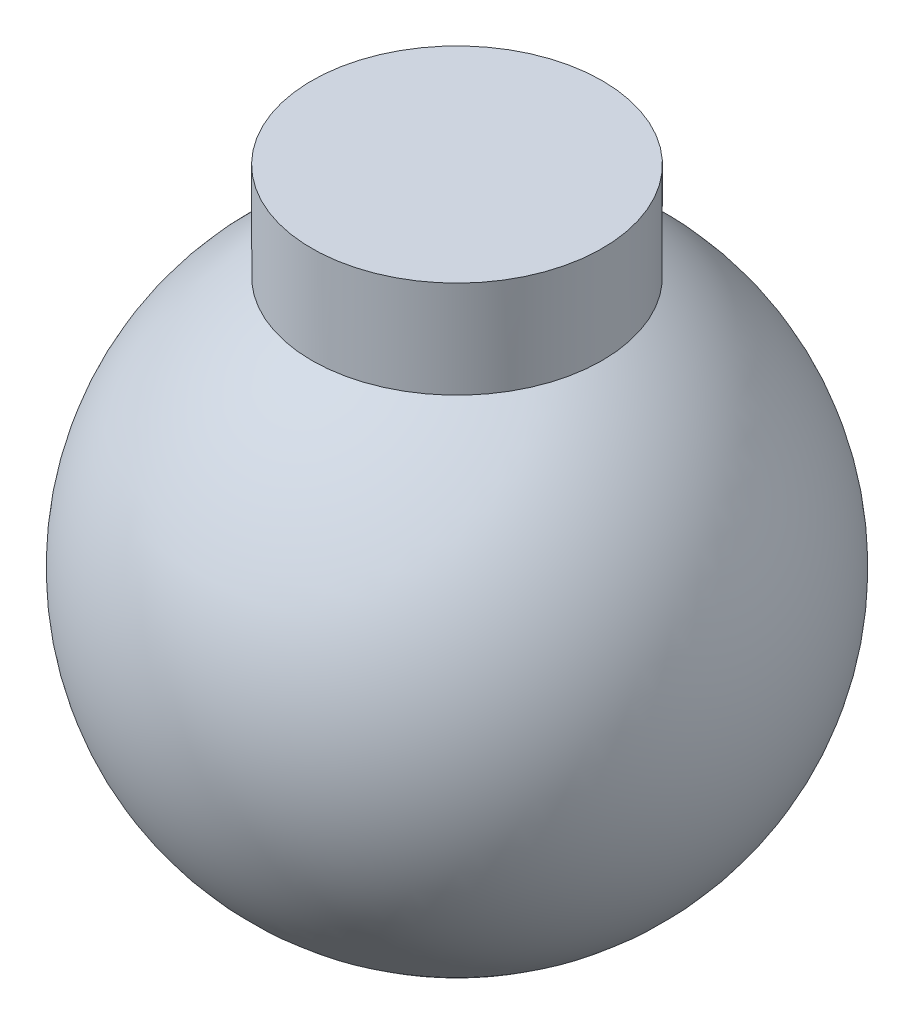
from build123d import *


with BuildPart() as part:
    # Sketch1 → Revolve1 (revolve)
    with BuildSketch(Plane.XY, mode=Mode.PRIVATE) as revolve1_sk:
        with BuildLine():
            Line((2.5, 4.330127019), (2.5, 6))
            Line((2.5, 6), (0, 6))
            Line((0, 6), (0, -5))
            ThreePointArc((0, -5), (4.829629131, -1.294095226), (2.5, 4.330127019))
        make_face()
    revolve(revolve1_sk.sketch.rotate(Axis((0, 0, 0), (0, 1, 0)), 180), axis=Axis((0, 0, 0), (0, 1, 0)))


solid = part.part
